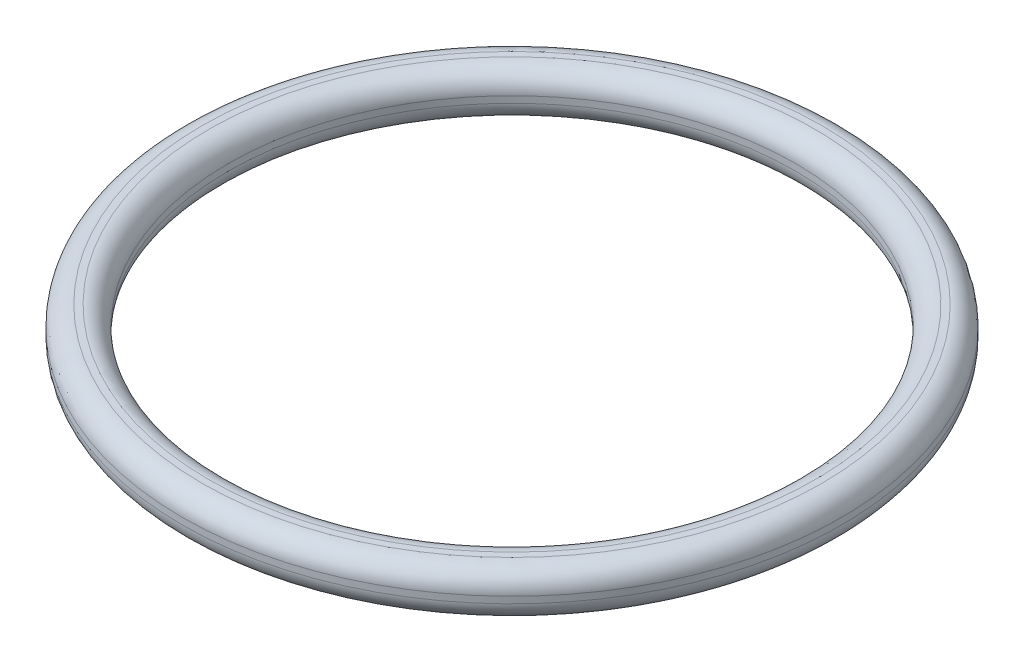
from build123d import *

# Parameters (mm, degrees)
SKETCH1_R           = 12.7508
SKETCH1_R_2         = 10.9728
BOSS_EXTRUDE1_DEPTH = 1.778
FILLET1_R           = 0.762


with BuildPart() as part:
    # Sketch1 → Boss-Extrude1 (new body)
    with BuildSketch(Plane(origin=(0, 0, 0), x_dir=(1, 0, 0), z_dir=(0, 1, 0))):
        with Locations(Location((0, 0, 0), (0, 0, 270))):
            Circle(SKETCH1_R)
        with Locations(Location((0, 0, 0), (0, 0, 270))):
            Circle(SKETCH1_R_2, mode=Mode.SUBTRACT)
    extrude(amount=BOSS_EXTRUDE1_DEPTH)

    # Fillet1
    fillet1_edges = [part.edges().sort_by_distance(p)[0] for p in [
        (0, 0, -12.7508),
        (0, 1.778, -12.7508),
        (0, 0, -10.9728),
        (0, 1.778, -10.9728),
    ]]
    fillet(fillet1_edges, radius=FILLET1_R)


solid = part.part
